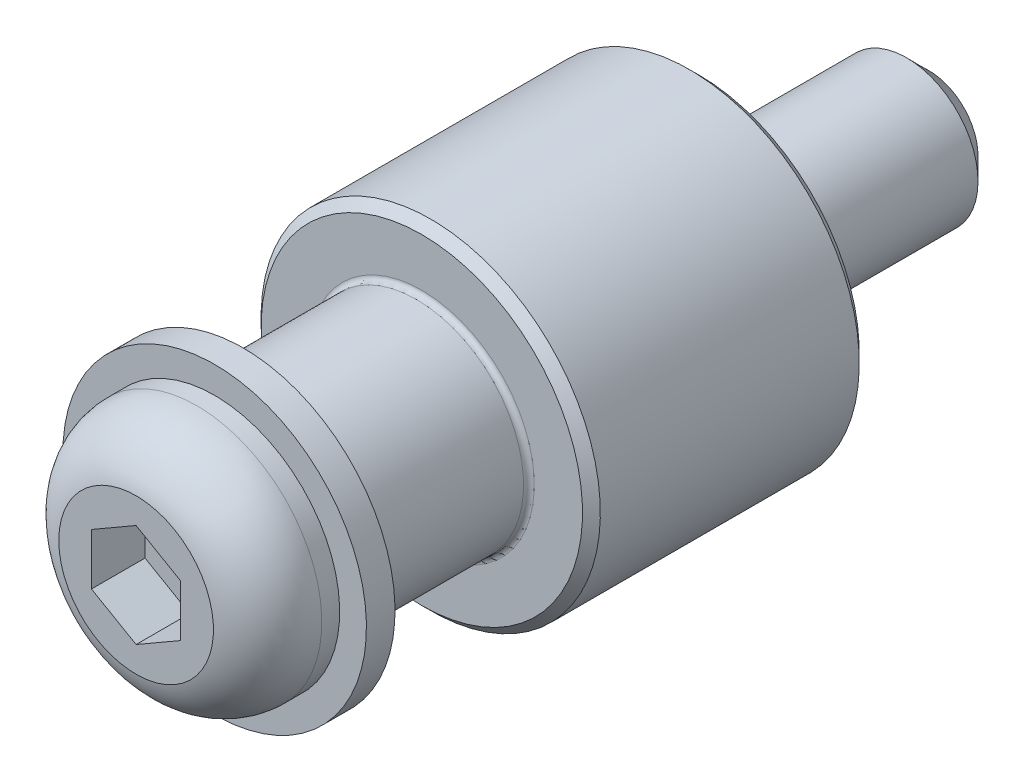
ISO-10303-21;
HEADER;
FILE_DESCRIPTION(('STEP AP214'),'2;1');
FILE_NAME('part.step','',(''),(''),'','','');
FILE_SCHEMA(('AUTOMOTIVE_DESIGN { 1 0 10303 214 1 1 1 1 }'));
ENDSEC;
DATA;
#1=APPLICATION_CONTEXT('core data for automotive mechanical design processes');
#2=APPLICATION_PROTOCOL_DEFINITION('international standard','automotive_design',2000,#1);
#3=PRODUCT_CONTEXT('',#1,'mechanical');
#4=PRODUCT('Part','Part','',(#3));
#5=PRODUCT_RELATED_PRODUCT_CATEGORY('part','',(#4));
#6=PRODUCT_DEFINITION_FORMATION('','',#4);
#7=PRODUCT_DEFINITION_CONTEXT('part definition',#1,'design');
#8=PRODUCT_DEFINITION('design','',#6,#7);
#9=PRODUCT_DEFINITION_SHAPE('','',#8);
#10=(LENGTH_UNIT() NAMED_UNIT(*) SI_UNIT(.MILLI.,.METRE.));
#11=(NAMED_UNIT(*) PLANE_ANGLE_UNIT() SI_UNIT($,.RADIAN.));
#12=(NAMED_UNIT(*) SI_UNIT($,.STERADIAN.) SOLID_ANGLE_UNIT());
#13=UNCERTAINTY_MEASURE_WITH_UNIT(LENGTH_MEASURE(1.E-05),#10,'distance_accuracy_value','');
#14=(GEOMETRIC_REPRESENTATION_CONTEXT(3) GLOBAL_UNCERTAINTY_ASSIGNED_CONTEXT((#13)) GLOBAL_UNIT_ASSIGNED_CONTEXT((#10,
#11,#12)) REPRESENTATION_CONTEXT('',''));
#15=CARTESIAN_POINT('',(0.,0.,0.));
#16=DIRECTION('',(0.,0.,1.));
#17=DIRECTION('',(1.,0.,0.));
#18=AXIS2_PLACEMENT_3D('',#15,#16,#17);
#19=CARTESIAN_POINT('',(2.5,1.44337567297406,28.5));
#20=DIRECTION('',(0.,0.,1.));
#21=DIRECTION('',(0.5,-0.866025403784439,0.));
#22=AXIS2_PLACEMENT_3D('',#19,#20,#21);
#23=PLANE('',#22);
#24=DIRECTION('',(0.,1.,0.));
#25=VECTOR('',#24,1.);
#26=CARTESIAN_POINT('',(2.5,-1.44337567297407,28.5));
#27=LINE('',#26,#25);
#28=CARTESIAN_POINT('',(2.5,-1.44337567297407,28.5));
#29=VERTEX_POINT('',#28);
#30=CARTESIAN_POINT('',(2.5,1.44337567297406,28.5));
#31=VERTEX_POINT('',#30);
#32=EDGE_CURVE('E101',#29,#31,#27,.T.);
#33=ORIENTED_EDGE('',*,*,#32,.T.);
#34=DIRECTION('',(-0.866025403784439,0.5,0.));
#35=VECTOR('',#34,1.);
#36=CARTESIAN_POINT('',(2.5,1.44337567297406,28.5));
#37=LINE('',#36,#35);
#38=CARTESIAN_POINT('',(0.,2.88675134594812,28.5));
#39=VERTEX_POINT('',#38);
#40=EDGE_CURVE('E104',#31,#39,#37,.T.);
#41=ORIENTED_EDGE('',*,*,#40,.T.);
#42=DIRECTION('',(-0.866025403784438,-0.5,0.));
#43=VECTOR('',#42,1.);
#44=CARTESIAN_POINT('',(0.,2.88675134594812,28.5));
#45=LINE('',#44,#43);
#46=CARTESIAN_POINT('',(-2.5,1.44337567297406,28.5));
#47=VERTEX_POINT('',#46);
#48=EDGE_CURVE('E75',#39,#47,#45,.T.);
#49=ORIENTED_EDGE('',*,*,#48,.T.);
#50=DIRECTION('',(0.,-1.,0.));
#51=VECTOR('',#50,1.);
#52=CARTESIAN_POINT('',(-2.5,1.44337567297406,28.5));
#53=LINE('',#52,#51);
#54=CARTESIAN_POINT('',(-2.5,-1.44337567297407,28.5));
#55=VERTEX_POINT('',#54);
#56=EDGE_CURVE('E107',#47,#55,#53,.T.);
#57=ORIENTED_EDGE('',*,*,#56,.T.);
#58=DIRECTION('',(0.866025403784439,-0.5,0.));
#59=VECTOR('',#58,1.);
#60=CARTESIAN_POINT('',(-2.5,-1.44337567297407,28.5));
#61=LINE('',#60,#59);
#62=CARTESIAN_POINT('',(0.,-2.88675134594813,28.5));
#63=VERTEX_POINT('',#62);
#64=EDGE_CURVE('E110',#55,#63,#61,.T.);
#65=ORIENTED_EDGE('',*,*,#64,.T.);
#66=DIRECTION('',(0.866025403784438,0.5,0.));
#67=VECTOR('',#66,1.);
#68=CARTESIAN_POINT('',(0.,-2.88675134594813,28.5));
#69=LINE('',#68,#67);
#70=EDGE_CURVE('E113',#63,#29,#69,.T.);
#71=ORIENTED_EDGE('',*,*,#70,.T.);
#72=EDGE_LOOP('',(#33,#41,#49,#57,#65,#71));
#73=FACE_BOUND('',#72,.T.);
#74=ADVANCED_FACE('F14',(#73),#23,.T.);
#75=CARTESIAN_POINT('',(0.,2.88675134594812,28.5));
#76=DIRECTION('',(-0.5,0.866025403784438,0.));
#77=DIRECTION('',(-0.866025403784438,-0.5,0.));
#78=AXIS2_PLACEMENT_3D('',#75,#76,#77);
#79=PLANE('',#78);
#80=DIRECTION('',(-0.866025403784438,-0.5,0.));
#81=VECTOR('',#80,1.);
#82=CARTESIAN_POINT('',(0.,2.88675134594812,31.5));
#83=LINE('',#82,#81);
#84=CARTESIAN_POINT('',(0.,2.88675134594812,31.5));
#85=VERTEX_POINT('',#84);
#86=CARTESIAN_POINT('',(-2.5,1.44337567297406,31.5));
#87=VERTEX_POINT('',#86);
#88=EDGE_CURVE('E72',#85,#87,#83,.T.);
#89=ORIENTED_EDGE('',*,*,#88,.T.);
#90=DIRECTION('',(0.,0.,1.));
#91=VECTOR('',#90,1.);
#92=CARTESIAN_POINT('',(-2.5,1.44337567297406,28.5));
#93=LINE('',#92,#91);
#94=EDGE_CURVE('E79',#47,#87,#93,.T.);
#95=ORIENTED_EDGE('',*,*,#94,.F.);
#96=ORIENTED_EDGE('',*,*,#48,.F.);
#97=DIRECTION('',(0.,0.,1.));
#98=VECTOR('',#97,1.);
#99=CARTESIAN_POINT('',(0.,2.88675134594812,28.5));
#100=LINE('',#99,#98);
#101=EDGE_CURVE('E68',#39,#85,#100,.T.);
#102=ORIENTED_EDGE('',*,*,#101,.T.);
#103=EDGE_LOOP('',(#89,#95,#96,#102));
#104=FACE_BOUND('',#103,.T.);
#105=ADVANCED_FACE('F70',(#104),#79,.F.);
#106=CARTESIAN_POINT('',(-2.5,1.44337567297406,28.5));
#107=DIRECTION('',(-1.,0.,0.));
#108=DIRECTION('',(0.,-1.,0.));
#109=AXIS2_PLACEMENT_3D('',#106,#107,#108);
#110=PLANE('',#109);
#111=DIRECTION('',(0.,-1.,0.));
#112=VECTOR('',#111,1.);
#113=CARTESIAN_POINT('',(-2.5,1.44337567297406,31.5));
#114=LINE('',#113,#112);
#115=CARTESIAN_POINT('',(-2.5,-1.44337567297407,31.5));
#116=VERTEX_POINT('',#115);
#117=EDGE_CURVE('E91',#87,#116,#114,.T.);
#118=ORIENTED_EDGE('',*,*,#117,.T.);
#119=DIRECTION('',(0.,0.,1.));
#120=VECTOR('',#119,1.);
#121=CARTESIAN_POINT('',(-2.5,-1.44337567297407,28.5));
#122=LINE('',#121,#120);
#123=EDGE_CURVE('E120',#55,#116,#122,.T.);
#124=ORIENTED_EDGE('',*,*,#123,.F.);
#125=ORIENTED_EDGE('',*,*,#56,.F.);
#126=ORIENTED_EDGE('',*,*,#94,.T.);
#127=EDGE_LOOP('',(#118,#124,#125,#126));
#128=FACE_BOUND('',#127,.T.);
#129=ADVANCED_FACE('F294',(#128),#110,.F.);
#130=CARTESIAN_POINT('',(-2.5,-1.44337567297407,28.5));
#131=DIRECTION('',(-0.5,-0.866025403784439,0.));
#132=DIRECTION('',(0.866025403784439,-0.5,0.));
#133=AXIS2_PLACEMENT_3D('',#130,#131,#132);
#134=PLANE('',#133);
#135=DIRECTION('',(0.866025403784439,-0.5,0.));
#136=VECTOR('',#135,1.);
#137=CARTESIAN_POINT('',(-2.5,-1.44337567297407,31.5));
#138=LINE('',#137,#136);
#139=CARTESIAN_POINT('',(0.,-2.88675134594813,31.5));
#140=VERTEX_POINT('',#139);
#141=EDGE_CURVE('E93',#116,#140,#138,.T.);
#142=ORIENTED_EDGE('',*,*,#141,.T.);
#143=DIRECTION('',(0.,0.,1.));
#144=VECTOR('',#143,1.);
#145=CARTESIAN_POINT('',(0.,-2.88675134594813,28.5));
#146=LINE('',#145,#144);
#147=EDGE_CURVE('E118',#63,#140,#146,.T.);
#148=ORIENTED_EDGE('',*,*,#147,.F.);
#149=ORIENTED_EDGE('',*,*,#64,.F.);
#150=ORIENTED_EDGE('',*,*,#123,.T.);
#151=EDGE_LOOP('',(#142,#148,#149,#150));
#152=FACE_BOUND('',#151,.T.);
#153=ADVANCED_FACE('F291',(#152),#134,.F.);
#154=CARTESIAN_POINT('',(0.,-2.88675134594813,28.5));
#155=DIRECTION('',(0.5,-0.866025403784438,0.));
#156=DIRECTION('',(0.866025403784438,0.5,0.));
#157=AXIS2_PLACEMENT_3D('',#154,#155,#156);
#158=PLANE('',#157);
#159=DIRECTION('',(0.866025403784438,0.5,0.));
#160=VECTOR('',#159,1.);
#161=CARTESIAN_POINT('',(0.,-2.88675134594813,31.5));
#162=LINE('',#161,#160);
#163=CARTESIAN_POINT('',(2.5,-1.44337567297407,31.5));
#164=VERTEX_POINT('',#163);
#165=EDGE_CURVE('E99',#140,#164,#162,.T.);
#166=ORIENTED_EDGE('',*,*,#165,.T.);
#167=DIRECTION('',(0.,0.,1.));
#168=VECTOR('',#167,1.);
#169=CARTESIAN_POINT('',(2.5,-1.44337567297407,28.5));
#170=LINE('',#169,#168);
#171=EDGE_CURVE('E36',#29,#164,#170,.T.);
#172=ORIENTED_EDGE('',*,*,#171,.F.);
#173=ORIENTED_EDGE('',*,*,#70,.F.);
#174=ORIENTED_EDGE('',*,*,#147,.T.);
#175=EDGE_LOOP('',(#166,#172,#173,#174));
#176=FACE_BOUND('',#175,.T.);
#177=ADVANCED_FACE('F287',(#176),#158,.F.);
#178=CARTESIAN_POINT('',(2.5,-1.44337567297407,28.5));
#179=DIRECTION('',(1.,0.,0.));
#180=DIRECTION('',(0.,1.,0.));
#181=AXIS2_PLACEMENT_3D('',#178,#179,#180);
#182=PLANE('',#181);
#183=DIRECTION('',(0.,1.,0.));
#184=VECTOR('',#183,1.);
#185=CARTESIAN_POINT('',(2.5,-1.44337567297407,31.5));
#186=LINE('',#185,#184);
#187=CARTESIAN_POINT('',(2.5,1.44337567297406,31.5));
#188=VERTEX_POINT('',#187);
#189=EDGE_CURVE('E29',#164,#188,#186,.T.);
#190=ORIENTED_EDGE('',*,*,#189,.T.);
#191=DIRECTION('',(0.,0.,1.));
#192=VECTOR('',#191,1.);
#193=CARTESIAN_POINT('',(2.5,1.44337567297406,28.5));
#194=LINE('',#193,#192);
#195=EDGE_CURVE('E80',#31,#188,#194,.T.);
#196=ORIENTED_EDGE('',*,*,#195,.F.);
#197=ORIENTED_EDGE('',*,*,#32,.F.);
#198=ORIENTED_EDGE('',*,*,#171,.T.);
#199=EDGE_LOOP('',(#190,#196,#197,#198));
#200=FACE_BOUND('',#199,.T.);
#201=ADVANCED_FACE('F290',(#200),#182,.F.);
#202=CARTESIAN_POINT('',(2.5,1.44337567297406,28.5));
#203=DIRECTION('',(0.5,0.866025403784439,0.));
#204=DIRECTION('',(-0.866025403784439,0.5,0.));
#205=AXIS2_PLACEMENT_3D('',#202,#203,#204);
#206=PLANE('',#205);
#207=DIRECTION('',(-0.866025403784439,0.5,0.));
#208=VECTOR('',#207,1.);
#209=CARTESIAN_POINT('',(2.5,1.44337567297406,31.5));
#210=LINE('',#209,#208);
#211=EDGE_CURVE('E83',#188,#85,#210,.T.);
#212=ORIENTED_EDGE('',*,*,#211,.T.);
#213=ORIENTED_EDGE('',*,*,#101,.F.);
#214=ORIENTED_EDGE('',*,*,#40,.F.);
#215=ORIENTED_EDGE('',*,*,#195,.T.);
#216=EDGE_LOOP('',(#212,#213,#214,#215));
#217=FACE_BOUND('',#216,.T.);
#218=ADVANCED_FACE('F84',(#217),#206,.F.);
#219=CARTESIAN_POINT('',(0.,0.,31.5));
#220=DIRECTION('',(0.,0.,-1.));
#221=DIRECTION('',(-0.5,0.866025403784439,0.));
#222=AXIS2_PLACEMENT_3D('',#219,#220,#221);
#223=PLANE('',#222);
#224=ORIENTED_EDGE('',*,*,#211,.F.);
#225=ORIENTED_EDGE('',*,*,#189,.F.);
#226=ORIENTED_EDGE('',*,*,#165,.F.);
#227=ORIENTED_EDGE('',*,*,#141,.F.);
#228=ORIENTED_EDGE('',*,*,#117,.F.);
#229=ORIENTED_EDGE('',*,*,#88,.F.);
#230=EDGE_LOOP('',(#224,#225,#226,#227,#228,#229));
#231=FACE_BOUND('',#230,.T.);
#232=CARTESIAN_POINT('',(0.,0.,31.5));
#233=DIRECTION('',(0.,0.,1.));
#234=DIRECTION('',(0.5,-0.866025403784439,0.));
#235=AXIS2_PLACEMENT_3D('',#232,#233,#234);
#236=CIRCLE('',#235,4.3306623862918);
#237=CARTESIAN_POINT('',(2.1653311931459,-3.75046364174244,31.5));
#238=VERTEX_POINT('',#237);
#239=EDGE_CURVE('E126',#238,#238,#236,.T.);
#240=ORIENTED_EDGE('',*,*,#239,.T.);
#241=EDGE_LOOP('',(#240));
#242=FACE_BOUND('',#241,.T.);
#243=ADVANCED_FACE('F87',(#231,#242),#223,.F.);
#244=CARTESIAN_POINT('',(0.,0.,28.1));
#245=DIRECTION('',(0.,0.,1.));
#246=DIRECTION('',(0.5,-0.866025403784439,0.));
#247=AXIS2_PLACEMENT_3D('',#244,#245,#246);
#248=DEGENERATE_TOROIDAL_SURFACE('',#247,3.5,3.5,.T.);
#249=ORIENTED_EDGE('',*,*,#239,.F.);
#250=EDGE_LOOP('',(#249));
#251=FACE_BOUND('',#250,.T.);
#252=CARTESIAN_POINT('',(0.,0.,28.1));
#253=DIRECTION('',(0.,0.,1.));
#254=DIRECTION('',(0.5,-0.866025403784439,0.));
#255=AXIS2_PLACEMENT_3D('',#252,#253,#254);
#256=CIRCLE('',#255,7.);
#257=CARTESIAN_POINT('',(3.5,-6.06217782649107,28.1));
#258=VERTEX_POINT('',#257);
#259=EDGE_CURVE('E129',#258,#258,#256,.T.);
#260=ORIENTED_EDGE('',*,*,#259,.T.);
#261=EDGE_LOOP('',(#260));
#262=FACE_BOUND('',#261,.T.);
#263=ADVANCED_FACE('F170',(#251,#262),#248,.T.);
#264=CARTESIAN_POINT('',(0.,0.,31.5));
#265=DIRECTION('',(0.,0.,1.));
#266=DIRECTION('',(0.5,-0.866025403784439,0.));
#267=AXIS2_PLACEMENT_3D('',#264,#265,#266);
#268=CYLINDRICAL_SURFACE('',#267,7.);
#269=ORIENTED_EDGE('',*,*,#259,.F.);
#270=EDGE_LOOP('',(#269));
#271=FACE_BOUND('',#270,.T.);
#272=CARTESIAN_POINT('',(0.,0.,27.1));
#273=DIRECTION('',(0.,0.,1.));
#274=DIRECTION('',(0.5,-0.866025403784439,0.));
#275=AXIS2_PLACEMENT_3D('',#272,#273,#274);
#276=CIRCLE('',#275,7.);
#277=CARTESIAN_POINT('',(3.5,-6.06217782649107,27.1));
#278=VERTEX_POINT('',#277);
#279=EDGE_CURVE('E132',#278,#278,#276,.T.);
#280=ORIENTED_EDGE('',*,*,#279,.T.);
#281=EDGE_LOOP('',(#280));
#282=FACE_BOUND('',#281,.T.);
#283=ADVANCED_FACE('F158',(#271,#282),#268,.T.);
#284=CARTESIAN_POINT('',(0.,0.,31.5));
#285=DIRECTION('',(0.,0.,1.));
#286=DIRECTION('',(0.5,-0.866025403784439,0.));
#287=AXIS2_PLACEMENT_3D('',#284,#285,#286);
#288=CYLINDRICAL_SURFACE('',#287,4.);
#289=CARTESIAN_POINT('',(0.,0.,-11.65));
#290=DIRECTION('',(0.,0.,1.));
#291=DIRECTION('',(-0.5,0.866025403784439,0.));
#292=AXIS2_PLACEMENT_3D('',#289,#290,#291);
#293=CIRCLE('',#292,4.);
#294=CARTESIAN_POINT('',(-2.,3.46410161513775,-11.65));
#295=VERTEX_POINT('',#294);
#296=EDGE_CURVE('E9',#295,#295,#293,.T.);
#297=ORIENTED_EDGE('',*,*,#296,.T.);
#298=EDGE_LOOP('',(#297));
#299=FACE_BOUND('',#298,.T.);
#300=CARTESIAN_POINT('',(0.,0.,0.));
#301=DIRECTION('',(0.,0.,-1.));
#302=DIRECTION('',(-0.866025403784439,-0.5,0.));
#303=AXIS2_PLACEMENT_3D('',#300,#301,#302);
#304=CIRCLE('',#303,4.);
#305=CARTESIAN_POINT('',(-3.46410161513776,-2.,0.));
#306=VERTEX_POINT('',#305);
#307=EDGE_CURVE('E135',#306,#306,#304,.T.);
#308=ORIENTED_EDGE('',*,*,#307,.T.);
#309=EDGE_LOOP('',(#308));
#310=FACE_BOUND('',#309,.T.);
#311=ADVANCED_FACE('F155',(#299,#310),#288,.T.);
#312=CARTESIAN_POINT('',(0.,0.,27.1));
#313=DIRECTION('',(0.,0.,1.));
#314=DIRECTION('',(0.5,-0.866025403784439,0.));
#315=AXIS2_PLACEMENT_3D('',#312,#313,#314);
#316=CIRCLE('',#315,4.);
#317=CARTESIAN_POINT('',(2.,-3.46410161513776,27.1));
#318=VERTEX_POINT('',#317);
#319=EDGE_CURVE('E117',#318,#318,#316,.T.);
#320=ORIENTED_EDGE('',*,*,#319,.F.);
#321=EDGE_LOOP('',(#320));
#322=FACE_BOUND('',#321,.T.);
#323=CARTESIAN_POINT('',(0.,0.,25.));
#324=DIRECTION('',(0.,0.,-1.));
#325=DIRECTION('',(-0.866025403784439,-0.5,0.));
#326=AXIS2_PLACEMENT_3D('',#323,#324,#325);
#327=CIRCLE('',#326,4.);
#328=CARTESIAN_POINT('',(-3.46410161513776,-2.,25.));
#329=VERTEX_POINT('',#328);
#330=EDGE_CURVE('E138',#329,#329,#327,.T.);
#331=ORIENTED_EDGE('',*,*,#330,.F.);
#332=EDGE_LOOP('',(#331));
#333=FACE_BOUND('',#332,.T.);
#334=ADVANCED_FACE('F157',(#322,#333),#288,.T.);
#335=CARTESIAN_POINT('',(-2.,3.46410161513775,27.1));
#336=DIRECTION('',(0.,0.,1.));
#337=DIRECTION('',(0.5,-0.866025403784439,0.));
#338=AXIS2_PLACEMENT_3D('',#335,#336,#337);
#339=PLANE('',#338);
#340=CARTESIAN_POINT('',(0.,0.,27.1));
#341=DIRECTION('',(0.,0.,1.));
#342=DIRECTION('',(-0.5,0.866025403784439,0.));
#343=AXIS2_PLACEMENT_3D('',#340,#341,#342);
#344=CIRCLE('',#343,4.2);
#345=CARTESIAN_POINT('',(-2.1,3.63730669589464,27.1));
#346=VERTEX_POINT('',#345);
#347=EDGE_CURVE('E136',#346,#346,#344,.F.);
#348=ORIENTED_EDGE('',*,*,#347,.T.);
#349=EDGE_LOOP('',(#348));
#350=FACE_BOUND('',#349,.T.);
#351=ORIENTED_EDGE('',*,*,#319,.T.);
#352=EDGE_LOOP('',(#351));
#353=FACE_BOUND('',#352,.T.);
#354=ADVANCED_FACE('F167',(#350,#353),#339,.F.);
#355=CARTESIAN_POINT('',(0.,0.,27.1));
#356=DIRECTION('',(0.,0.,-1.));
#357=DIRECTION('',(-0.866025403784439,-0.5,0.));
#358=AXIS2_PLACEMENT_3D('',#355,#356,#357);
#359=CYLINDRICAL_SURFACE('',#358,8.5);
#360=CARTESIAN_POINT('',(0.,0.,27.1));
#361=DIRECTION('',(0.,0.,1.));
#362=DIRECTION('',(0.866025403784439,0.5,0.));
#363=AXIS2_PLACEMENT_3D('',#360,#361,#362);
#364=CIRCLE('',#363,8.5);
#365=CARTESIAN_POINT('',(7.36121593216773,4.25,27.1));
#366=VERTEX_POINT('',#365);
#367=EDGE_CURVE('E257',#366,#366,#364,.T.);
#368=ORIENTED_EDGE('',*,*,#367,.F.);
#369=EDGE_LOOP('',(#368));
#370=FACE_BOUND('',#369,.T.);
#371=CARTESIAN_POINT('',(0.,0.,25.5));
#372=DIRECTION('',(0.,0.,1.));
#373=DIRECTION('',(0.866025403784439,0.5,0.));
#374=AXIS2_PLACEMENT_3D('',#371,#372,#373);
#375=CIRCLE('',#374,8.5);
#376=CARTESIAN_POINT('',(7.36121593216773,4.25,25.5));
#377=VERTEX_POINT('',#376);
#378=EDGE_CURVE('E254',#377,#377,#375,.T.);
#379=ORIENTED_EDGE('',*,*,#378,.T.);
#380=EDGE_LOOP('',(#379));
#381=FACE_BOUND('',#380,.T.);
#382=ADVANCED_FACE('F263',(#370,#381),#359,.T.);
#383=CARTESIAN_POINT('',(0.,0.,27.1));
#384=DIRECTION('',(0.,0.,1.));
#385=DIRECTION('',(0.866025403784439,0.5,0.));
#386=AXIS2_PLACEMENT_3D('',#383,#384,#385);
#387=PLANE('',#386);
#388=ORIENTED_EDGE('',*,*,#367,.T.);
#389=EDGE_LOOP('',(#388));
#390=FACE_BOUND('',#389,.T.);
#391=ORIENTED_EDGE('',*,*,#279,.F.);
#392=EDGE_LOOP('',(#391));
#393=FACE_BOUND('',#392,.T.);
#394=ADVANCED_FACE('F173',(#390,#393),#387,.T.);
#395=CARTESIAN_POINT('',(0.,0.,25.5));
#396=DIRECTION('',(0.,0.,1.));
#397=DIRECTION('',(0.866025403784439,0.5,0.));
#398=AXIS2_PLACEMENT_3D('',#395,#396,#397);
#399=PLANE('',#398);
#400=ORIENTED_EDGE('',*,*,#378,.F.);
#401=EDGE_LOOP('',(#400));
#402=FACE_BOUND('',#401,.T.);
#403=CARTESIAN_POINT('',(0.,0.,25.5));
#404=DIRECTION('',(0.,0.,1.));
#405=DIRECTION('',(0.866025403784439,0.5,0.));
#406=AXIS2_PLACEMENT_3D('',#403,#404,#405);
#407=CIRCLE('',#406,4.2);
#408=CARTESIAN_POINT('',(3.63730669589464,2.1,25.5));
#409=VERTEX_POINT('',#408);
#410=EDGE_CURVE('E251',#409,#409,#407,.T.);
#411=ORIENTED_EDGE('',*,*,#410,.T.);
#412=EDGE_LOOP('',(#411));
#413=FACE_BOUND('',#412,.T.);
#414=ADVANCED_FACE('F267',(#402,#413),#399,.F.);
#415=CARTESIAN_POINT('',(0.,0.,27.1));
#416=DIRECTION('',(0.,0.,-1.));
#417=DIRECTION('',(-0.866025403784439,-0.5,0.));
#418=AXIS2_PLACEMENT_3D('',#415,#416,#417);
#419=CYLINDRICAL_SURFACE('',#418,4.2);
#420=ORIENTED_EDGE('',*,*,#347,.F.);
#421=EDGE_LOOP('',(#420));
#422=FACE_BOUND('',#421,.T.);
#423=ORIENTED_EDGE('',*,*,#410,.F.);
#424=EDGE_LOOP('',(#423));
#425=FACE_BOUND('',#424,.T.);
#426=ADVANCED_FACE('F153',(#422,#425),#419,.F.);
#427=CARTESIAN_POINT('',(0.,0.,15.8));
#428=DIRECTION('',(0.,0.,1.));
#429=DIRECTION('',(0.866025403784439,0.5,0.));
#430=AXIS2_PLACEMENT_3D('',#427,#428,#429);
#431=TOROIDAL_SURFACE('',#430,6.3,0.3);
#432=CARTESIAN_POINT('',(0.,0.,15.8));
#433=DIRECTION('',(0.,0.,1.));
#434=DIRECTION('',(0.866025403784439,0.5,0.));
#435=AXIS2_PLACEMENT_3D('',#432,#433,#434);
#436=CIRCLE('',#435,6.);
#437=CARTESIAN_POINT('',(5.19615242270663,3.,15.8));
#438=VERTEX_POINT('',#437);
#439=EDGE_CURVE('E249',#438,#438,#436,.T.);
#440=ORIENTED_EDGE('',*,*,#439,.F.);
#441=EDGE_LOOP('',(#440));
#442=FACE_BOUND('',#441,.T.);
#443=CARTESIAN_POINT('',(0.,0.,15.5));
#444=DIRECTION('',(0.,0.,1.));
#445=DIRECTION('',(0.866025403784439,0.5,0.));
#446=AXIS2_PLACEMENT_3D('',#443,#444,#445);
#447=CIRCLE('',#446,6.3);
#448=CARTESIAN_POINT('',(5.45596004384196,3.15,15.5));
#449=VERTEX_POINT('',#448);
#450=EDGE_CURVE('E246',#449,#449,#447,.F.);
#451=ORIENTED_EDGE('',*,*,#450,.F.);
#452=EDGE_LOOP('',(#451));
#453=FACE_BOUND('',#452,.T.);
#454=ADVANCED_FACE('F169',(#442,#453),#431,.F.);
#455=CARTESIAN_POINT('',(0.,0.,0.));
#456=DIRECTION('',(0.,0.,-1.));
#457=DIRECTION('',(-0.866025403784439,-0.5,0.));
#458=AXIS2_PLACEMENT_3D('',#455,#456,#457);
#459=CYLINDRICAL_SURFACE('',#458,6.);
#460=ORIENTED_EDGE('',*,*,#439,.T.);
#461=EDGE_LOOP('',(#460));
#462=FACE_BOUND('',#461,.T.);
#463=CARTESIAN_POINT('',(0.,0.,24.5));
#464=DIRECTION('',(0.,0.,1.));
#465=DIRECTION('',(0.866025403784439,0.5,0.));
#466=AXIS2_PLACEMENT_3D('',#463,#464,#465);
#467=CIRCLE('',#466,6.);
#468=CARTESIAN_POINT('',(5.19615242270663,3.,24.5));
#469=VERTEX_POINT('',#468);
#470=EDGE_CURVE('E241',#469,#469,#467,.F.);
#471=ORIENTED_EDGE('',*,*,#470,.T.);
#472=EDGE_LOOP('',(#471));
#473=FACE_BOUND('',#472,.T.);
#474=ADVANCED_FACE('F181',(#462,#473),#459,.T.);
#475=CARTESIAN_POINT('',(0.,0.,24.5));
#476=DIRECTION('',(0.,0.,-1.));
#477=DIRECTION('',(-0.866025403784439,-0.5,0.));
#478=AXIS2_PLACEMENT_3D('',#475,#476,#477);
#479=CONICAL_SURFACE('',#478,6.,0.785398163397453);
#480=CARTESIAN_POINT('',(0.,0.,25.));
#481=DIRECTION('',(0.,0.,1.));
#482=DIRECTION('',(0.866025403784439,0.5,0.));
#483=AXIS2_PLACEMENT_3D('',#480,#481,#482);
#484=CIRCLE('',#483,5.5);
#485=CARTESIAN_POINT('',(4.76313972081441,2.75,25.));
#486=VERTEX_POINT('',#485);
#487=EDGE_CURVE('E244',#486,#486,#484,.T.);
#488=ORIENTED_EDGE('',*,*,#487,.F.);
#489=EDGE_LOOP('',(#488));
#490=FACE_BOUND('',#489,.T.);
#491=ORIENTED_EDGE('',*,*,#470,.F.);
#492=EDGE_LOOP('',(#491));
#493=FACE_BOUND('',#492,.T.);
#494=ADVANCED_FACE('F178',(#490,#493),#479,.T.);
#495=CARTESIAN_POINT('',(-3.,5.19615242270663,25.));
#496=DIRECTION('',(0.,0.,1.));
#497=DIRECTION('',(0.866025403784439,0.5,0.));
#498=AXIS2_PLACEMENT_3D('',#495,#496,#497);
#499=PLANE('',#498);
#500=ORIENTED_EDGE('',*,*,#487,.T.);
#501=EDGE_LOOP('',(#500));
#502=FACE_BOUND('',#501,.T.);
#503=ORIENTED_EDGE('',*,*,#330,.T.);
#504=EDGE_LOOP('',(#503));
#505=FACE_BOUND('',#504,.T.);
#506=ADVANCED_FACE('F161',(#502,#505),#499,.T.);
#507=CARTESIAN_POINT('',(-4.75,8.22724133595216,15.5));
#508=DIRECTION('',(0.,0.,1.));
#509=DIRECTION('',(0.866025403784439,0.5,0.));
#510=AXIS2_PLACEMENT_3D('',#507,#508,#509);
#511=PLANE('',#510);
#512=ORIENTED_EDGE('',*,*,#450,.T.);
#513=EDGE_LOOP('',(#512));
#514=FACE_BOUND('',#513,.T.);
#515=CARTESIAN_POINT('',(0.,0.,15.5));
#516=DIRECTION('',(0.,0.,1.));
#517=DIRECTION('',(0.866025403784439,0.5,0.));
#518=AXIS2_PLACEMENT_3D('',#515,#516,#517);
#519=CIRCLE('',#518,9.);
#520=CARTESIAN_POINT('',(7.79422863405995,4.5,15.5));
#521=VERTEX_POINT('',#520);
#522=EDGE_CURVE('E226',#521,#521,#519,.T.);
#523=ORIENTED_EDGE('',*,*,#522,.T.);
#524=EDGE_LOOP('',(#523));
#525=FACE_BOUND('',#524,.T.);
#526=ADVANCED_FACE('F177',(#514,#525),#511,.T.);
#527=CARTESIAN_POINT('',(0.,0.,15.));
#528=DIRECTION('',(0.,0.,-1.));
#529=DIRECTION('',(-0.866025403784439,-0.5,0.));
#530=AXIS2_PLACEMENT_3D('',#527,#528,#529);
#531=CONICAL_SURFACE('',#530,9.5,0.78539816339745);
#532=ORIENTED_EDGE('',*,*,#522,.F.);
#533=EDGE_LOOP('',(#532));
#534=FACE_BOUND('',#533,.T.);
#535=CARTESIAN_POINT('',(0.,0.,15.));
#536=DIRECTION('',(0.,0.,1.));
#537=DIRECTION('',(0.866025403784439,0.5,0.));
#538=AXIS2_PLACEMENT_3D('',#535,#536,#537);
#539=CIRCLE('',#538,9.5);
#540=CARTESIAN_POINT('',(8.22724133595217,4.75,15.));
#541=VERTEX_POINT('',#540);
#542=EDGE_CURVE('E229',#541,#541,#539,.F.);
#543=ORIENTED_EDGE('',*,*,#542,.F.);
#544=EDGE_LOOP('',(#543));
#545=FACE_BOUND('',#544,.T.);
#546=ADVANCED_FACE('F187',(#534,#545),#531,.T.);
#547=CARTESIAN_POINT('',(0.,0.,0.));
#548=DIRECTION('',(0.,0.,-1.));
#549=DIRECTION('',(-0.866025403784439,-0.5,0.));
#550=AXIS2_PLACEMENT_3D('',#547,#548,#549);
#551=CYLINDRICAL_SURFACE('',#550,9.5);
#552=CARTESIAN_POINT('',(0.,0.,0.5));
#553=DIRECTION('',(0.,0.,-1.));
#554=DIRECTION('',(-0.866025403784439,-0.5,0.));
#555=AXIS2_PLACEMENT_3D('',#552,#553,#554);
#556=CIRCLE('',#555,9.5);
#557=CARTESIAN_POINT('',(-8.22724133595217,-4.75,0.5));
#558=VERTEX_POINT('',#557);
#559=EDGE_CURVE('E231',#558,#558,#556,.F.);
#560=ORIENTED_EDGE('',*,*,#559,.T.);
#561=EDGE_LOOP('',(#560));
#562=FACE_BOUND('',#561,.T.);
#563=ORIENTED_EDGE('',*,*,#542,.T.);
#564=EDGE_LOOP('',(#563));
#565=FACE_BOUND('',#564,.T.);
#566=ADVANCED_FACE('F190',(#562,#565),#551,.T.);
#567=CARTESIAN_POINT('',(0.,0.,0.));
#568=DIRECTION('',(0.,0.,1.));
#569=DIRECTION('',(0.866025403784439,0.5,0.));
#570=AXIS2_PLACEMENT_3D('',#567,#568,#569);
#571=CONICAL_SURFACE('',#570,9.,0.785398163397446);
#572=ORIENTED_EDGE('',*,*,#559,.F.);
#573=EDGE_LOOP('',(#572));
#574=FACE_BOUND('',#573,.T.);
#575=CARTESIAN_POINT('',(0.,0.,0.));
#576=DIRECTION('',(0.,0.,-1.));
#577=DIRECTION('',(-0.866025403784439,-0.5,0.));
#578=AXIS2_PLACEMENT_3D('',#575,#576,#577);
#579=CIRCLE('',#578,9.);
#580=CARTESIAN_POINT('',(-7.79422863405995,-4.5,0.));
#581=VERTEX_POINT('',#580);
#582=EDGE_CURVE('E232',#581,#581,#579,.T.);
#583=ORIENTED_EDGE('',*,*,#582,.F.);
#584=EDGE_LOOP('',(#583));
#585=FACE_BOUND('',#584,.T.);
#586=ADVANCED_FACE('F210',(#574,#585),#571,.T.);
#587=CARTESIAN_POINT('',(0.,0.,0.));
#588=DIRECTION('',(0.,0.,-1.));
#589=DIRECTION('',(-0.866025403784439,-0.5,0.));
#590=AXIS2_PLACEMENT_3D('',#587,#588,#589);
#591=PLANE('',#590);
#592=ORIENTED_EDGE('',*,*,#582,.T.);
#593=EDGE_LOOP('',(#592));
#594=FACE_BOUND('',#593,.T.);
#595=ORIENTED_EDGE('',*,*,#307,.F.);
#596=EDGE_LOOP('',(#595));
#597=FACE_BOUND('',#596,.T.);
#598=ADVANCED_FACE('F151',(#594,#597),#591,.T.);
#599=CARTESIAN_POINT('',(-2.,3.46410161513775,-12.9));
#600=DIRECTION('',(0.,0.,1.));
#601=DIRECTION('',(0.5,-0.866025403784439,0.));
#602=AXIS2_PLACEMENT_3D('',#599,#600,#601);
#603=PLANE('',#602);
#604=CARTESIAN_POINT('',(0.,0.,-12.9));
#605=DIRECTION('',(0.,0.,1.));
#606=DIRECTION('',(-0.5,0.866025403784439,0.));
#607=AXIS2_PLACEMENT_3D('',#604,#605,#606);
#608=CIRCLE('',#607,2.75);
#609=CARTESIAN_POINT('',(-1.375,2.3815698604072,-12.9));
#610=VERTEX_POINT('',#609);
#611=EDGE_CURVE('E22',#610,#610,#608,.F.);
#612=ORIENTED_EDGE('',*,*,#611,.T.);
#613=EDGE_LOOP('',(#612));
#614=FACE_BOUND('',#613,.T.);
#615=ADVANCED_FACE('F142',(#614),#603,.F.);
#616=CARTESIAN_POINT('',(0.,0.,-12.9));
#617=DIRECTION('',(0.,0.,1.));
#618=DIRECTION('',(-0.5,0.866025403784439,0.));
#619=AXIS2_PLACEMENT_3D('',#616,#617,#618);
#620=CONICAL_SURFACE('',#619,2.75,0.78539816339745);
#621=ORIENTED_EDGE('',*,*,#296,.F.);
#622=EDGE_LOOP('',(#621));
#623=FACE_BOUND('',#622,.T.);
#624=ORIENTED_EDGE('',*,*,#611,.F.);
#625=EDGE_LOOP('',(#624));
#626=FACE_BOUND('',#625,.T.);
#627=ADVANCED_FACE('F16',(#623,#626),#620,.T.);
#628=CLOSED_SHELL('',(#74,#105,#129,#153,#177,#201,#218,#243,#263,#283,#311,#334,#354,#382,#394,
#414,#426,#454,#474,#494,#506,#526,#546,#566,#586,#598,#615,#627));
#629=MANIFOLD_SOLID_BREP('B1',#628);
#630=ADVANCED_BREP_SHAPE_REPRESENTATION('',(#18,#629),#14);
#631=SHAPE_DEFINITION_REPRESENTATION(#9,#630);
ENDSEC;
END-ISO-10303-21;
